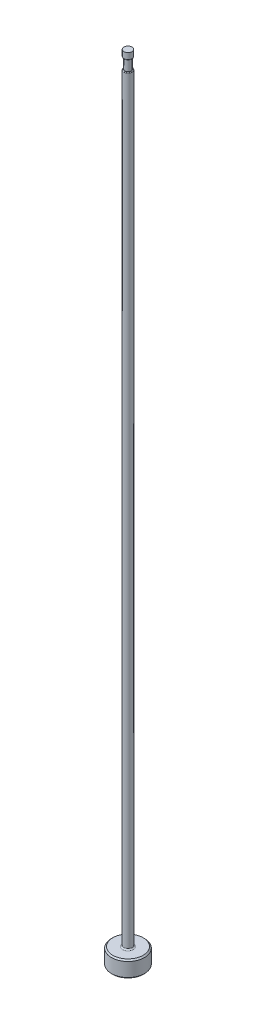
ISO-10303-21;
HEADER;
FILE_DESCRIPTION(('STEP AP214'),'2;1');
FILE_NAME('part.step','',(''),(''),'','','');
FILE_SCHEMA(('AUTOMOTIVE_DESIGN { 1 0 10303 214 1 1 1 1 }'));
ENDSEC;
DATA;
#1=APPLICATION_CONTEXT('core data for automotive mechanical design processes');
#2=APPLICATION_PROTOCOL_DEFINITION('international standard','automotive_design',2000,#1);
#3=PRODUCT_CONTEXT('',#1,'mechanical');
#4=PRODUCT('Part','Part','',(#3));
#5=PRODUCT_RELATED_PRODUCT_CATEGORY('part','',(#4));
#6=PRODUCT_DEFINITION_FORMATION('','',#4);
#7=PRODUCT_DEFINITION_CONTEXT('part definition',#1,'design');
#8=PRODUCT_DEFINITION('design','',#6,#7);
#9=PRODUCT_DEFINITION_SHAPE('','',#8);
#10=(LENGTH_UNIT() NAMED_UNIT(*) SI_UNIT(.MILLI.,.METRE.));
#11=(NAMED_UNIT(*) PLANE_ANGLE_UNIT() SI_UNIT($,.RADIAN.));
#12=(NAMED_UNIT(*) SI_UNIT($,.STERADIAN.) SOLID_ANGLE_UNIT());
#13=UNCERTAINTY_MEASURE_WITH_UNIT(LENGTH_MEASURE(1.E-05),#10,'distance_accuracy_value','');
#14=(GEOMETRIC_REPRESENTATION_CONTEXT(3) GLOBAL_UNCERTAINTY_ASSIGNED_CONTEXT((#13)) GLOBAL_UNIT_ASSIGNED_CONTEXT((#10,
#11,#12)) REPRESENTATION_CONTEXT('',''));
#15=CARTESIAN_POINT('',(0.,0.,0.));
#16=DIRECTION('',(0.,0.,1.));
#17=DIRECTION('',(1.,0.,0.));
#18=AXIS2_PLACEMENT_3D('',#15,#16,#17);
#19=CARTESIAN_POINT('',(-0.793749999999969,151.13,0.));
#20=DIRECTION('',(0.,1.,0.));
#21=DIRECTION('',(0.,0.,1.));
#22=AXIS2_PLACEMENT_3D('',#19,#20,#21);
#23=PLANE('',#22);
#24=CARTESIAN_POINT('',(0.,151.13,0.));
#25=DIRECTION('',(0.,1.,0.));
#26=DIRECTION('',(0.,0.,1.));
#27=AXIS2_PLACEMENT_3D('',#24,#25,#26);
#28=CIRCLE('',#27,0.654049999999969);
#29=CARTESIAN_POINT('',(0.,151.13,0.654049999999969));
#30=VERTEX_POINT('',#29);
#31=EDGE_CURVE('E11',#30,#30,#28,.F.);
#32=ORIENTED_EDGE('',*,*,#31,.T.);
#33=EDGE_LOOP('',(#32));
#34=FACE_BOUND('',#33,.T.);
#35=CARTESIAN_POINT('',(0.,151.13,0.));
#36=DIRECTION('',(0.,1.,0.));
#37=DIRECTION('',(0.,0.,1.));
#38=AXIS2_PLACEMENT_3D('',#35,#36,#37);
#39=CIRCLE('',#38,0.590549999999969);
#40=CARTESIAN_POINT('',(0.,151.13,0.590549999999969));
#41=VERTEX_POINT('',#40);
#42=EDGE_CURVE('E78',#41,#41,#39,.T.);
#43=ORIENTED_EDGE('',*,*,#42,.T.);
#44=EDGE_LOOP('',(#43));
#45=FACE_BOUND('',#44,.T.);
#46=ADVANCED_FACE('F36',(#34,#45),#23,.F.);
#47=CARTESIAN_POINT('',(0.,259.958771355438,0.));
#48=DIRECTION('',(0.,1.,0.));
#49=DIRECTION('',(0.,0.,1.));
#50=AXIS2_PLACEMENT_3D('',#47,#48,#49);
#51=CYLINDRICAL_SURFACE('',#50,0.793749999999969);
#52=DIRECTION('',(0.,1.,0.));
#53=VECTOR('',#52,1.);
#54=CARTESIAN_POINT('',(-0.590549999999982,259.958771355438,-0.530367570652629));
#55=LINE('',#54,#53);
#56=CARTESIAN_POINT('',(-0.590549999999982,148.971,-0.530367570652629));
#57=VERTEX_POINT('',#56);
#58=CARTESIAN_POINT('',(-0.590549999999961,86.614,-0.530367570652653));
#59=VERTEX_POINT('',#58);
#60=EDGE_CURVE('E73',#57,#59,#55,.F.);
#61=ORIENTED_EDGE('',*,*,#60,.F.);
#62=CARTESIAN_POINT('',(0.,148.971,0.));
#63=DIRECTION('',(0.,-1.,0.));
#64=DIRECTION('',(0.,0.,-1.));
#65=AXIS2_PLACEMENT_3D('',#62,#63,#64);
#66=CIRCLE('',#65,0.793749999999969);
#67=CARTESIAN_POINT('',(-0.590549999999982,148.971,0.530367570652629));
#68=VERTEX_POINT('',#67);
#69=EDGE_CURVE('E51',#57,#68,#66,.T.);
#70=ORIENTED_EDGE('',*,*,#69,.T.);
#71=DIRECTION('',(0.,1.,0.));
#72=VECTOR('',#71,1.);
#73=CARTESIAN_POINT('',(-0.590549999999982,259.958771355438,0.530367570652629));
#74=LINE('',#73,#72);
#75=CARTESIAN_POINT('',(-0.590549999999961,86.614,0.530367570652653));
#76=VERTEX_POINT('',#75);
#77=EDGE_CURVE('E84',#76,#68,#74,.T.);
#78=ORIENTED_EDGE('',*,*,#77,.F.);
#79=CARTESIAN_POINT('',(-0.590549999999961,86.614,-0.530367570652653));
#80=CARTESIAN_POINT('',(-0.59053917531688,86.5581966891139,-0.530314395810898));
#81=CARTESIAN_POINT('',(-0.592020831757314,86.5023728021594,-0.528725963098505));
#82=CARTESIAN_POINT('',(-0.597911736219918,86.3908205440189,-0.522091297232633));
#83=CARTESIAN_POINT('',(-0.602334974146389,86.3350939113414,-0.517028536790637));
#84=CARTESIAN_POINT('',(-0.614284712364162,86.2222022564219,-0.502771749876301));
#85=CARTESIAN_POINT('',(-0.621928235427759,86.1650688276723,-0.493420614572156));
#86=CARTESIAN_POINT('',(-0.640090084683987,86.0524288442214,-0.469629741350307));
#87=CARTESIAN_POINT('',(-0.650601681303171,85.9969188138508,-0.455201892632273));
#88=CARTESIAN_POINT('',(-0.672694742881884,85.8947751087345,-0.421752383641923));
#89=CARTESIAN_POINT('',(-0.684015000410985,85.8478538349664,-0.403447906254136));
#90=CARTESIAN_POINT('',(-0.707793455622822,85.7579254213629,-0.360113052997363));
#91=CARTESIAN_POINT('',(-0.720238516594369,85.7148824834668,-0.335155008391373));
#92=CARTESIAN_POINT('',(-0.738199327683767,85.6568429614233,-0.292081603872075));
#93=CARTESIAN_POINT('',(-0.743831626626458,85.6392421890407,-0.277537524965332));
#94=CARTESIAN_POINT('',(-0.754779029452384,85.6059385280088,-0.246220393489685));
#95=CARTESIAN_POINT('',(-0.760093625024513,85.5902386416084,-0.229443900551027));
#96=CARTESIAN_POINT('',(-0.770096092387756,85.5613279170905,-0.193256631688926));
#97=CARTESIAN_POINT('',(-0.774774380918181,85.5481541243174,-0.173812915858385));
#98=CARTESIAN_POINT('',(-0.782879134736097,85.525678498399,-0.132572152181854));
#99=CARTESIAN_POINT('',(-0.786309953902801,85.5163631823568,-0.110783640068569));
#100=CARTESIAN_POINT('',(-0.790553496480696,85.5049260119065,-0.0728220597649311));
#101=CARTESIAN_POINT('',(-0.791853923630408,85.5014525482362,-0.0571082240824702));
#102=CARTESIAN_POINT('',(-0.793506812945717,85.4970442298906,-0.02527858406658));
#103=CARTESIAN_POINT('',(-0.79385989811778,85.4961077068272,-0.00916305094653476));
#104=CARTESIAN_POINT('',(-0.79357975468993,85.4968527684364,0.0230049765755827));
#105=CARTESIAN_POINT('',(-0.792946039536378,85.4985356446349,0.0390574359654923));
#106=CARTESIAN_POINT('',(-0.790759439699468,85.5043804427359,0.0706385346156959));
#107=CARTESIAN_POINT('',(-0.789205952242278,85.5085439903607,0.086166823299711));
#108=CARTESIAN_POINT('',(-0.78484716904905,85.5203438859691,0.120053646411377));
#109=CARTESIAN_POINT('',(-0.781828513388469,85.5285809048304,0.138174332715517));
#110=CARTESIAN_POINT('',(-0.774926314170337,85.5477453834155,0.172744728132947));
#111=CARTESIAN_POINT('',(-0.77104126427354,85.5586775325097,0.189191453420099));
#112=CARTESIAN_POINT('',(-0.760742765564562,85.5882791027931,0.227766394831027));
#113=CARTESIAN_POINT('',(-0.754005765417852,85.6081551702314,0.248875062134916));
#114=CARTESIAN_POINT('',(-0.740079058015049,85.6508481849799,0.287657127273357));
#115=CARTESIAN_POINT('',(-0.732888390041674,85.6736714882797,0.305322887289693));
#116=CARTESIAN_POINT('',(-0.713188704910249,85.7390259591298,0.349810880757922));
#117=CARTESIAN_POINT('',(-0.700707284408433,85.7835752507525,0.373653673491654));
#118=CARTESIAN_POINT('',(-0.677153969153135,85.8759372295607,0.414797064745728));
#119=CARTESIAN_POINT('',(-0.666086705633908,85.9237598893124,0.432076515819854));
#120=CARTESIAN_POINT('',(-0.646811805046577,86.0171939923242,0.460367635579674));
#121=CARTESIAN_POINT('',(-0.638441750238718,86.0626519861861,0.4717848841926));
#122=CARTESIAN_POINT('',(-0.623612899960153,86.1546203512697,0.491217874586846));
#123=CARTESIAN_POINT('',(-0.617155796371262,86.2011316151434,0.499230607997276));
#124=CARTESIAN_POINT('',(-0.606291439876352,86.2947368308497,0.512368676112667));
#125=CARTESIAN_POINT('',(-0.601882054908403,86.3418301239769,0.517497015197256));
#126=CARTESIAN_POINT('',(-0.59516857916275,86.4363714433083,0.525204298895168));
#127=CARTESIAN_POINT('',(-0.592864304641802,86.4838194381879,0.527783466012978));
#128=CARTESIAN_POINT('',(-0.591267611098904,86.5451029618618,0.529567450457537));
#129=CARTESIAN_POINT('',(-0.590998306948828,86.5588916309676,0.52986795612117));
#130=CARTESIAN_POINT('',(-0.590639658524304,86.586453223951,0.530267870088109));
#131=CARTESIAN_POINT('',(-0.59055004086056,86.6002261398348,0.530367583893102));
#132=CARTESIAN_POINT('',(-0.59054999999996,86.6139999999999,0.530367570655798));
#133=B_SPLINE_CURVE_WITH_KNOTS('',3,(#79,#80,#81,#82,#83,#84,#85,#86,#87,#88,#89,#90,#91,#92,
#93,#94,#95,#96,#97,#98,#99,#100,#101,#102,#103,#104,#105,#106,#107,#108,#109,#110,#111,#112,
#113,#114,#115,#116,#117,#118,#119,#120,#121,#122,#123,#124,#125,#126,#127,#128,#129,#130,#131,
#132),.UNSPECIFIED.,.F.,.F.,(4,2,2,2,2,2,2,2,2,2,2,2,2,2,2,2,2,2,2,2,2,2,2,2,2,2,4),(0.,
0.167401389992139,0.335604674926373,0.510534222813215,0.68505679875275,0.839551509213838,
0.992430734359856,1.0628421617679,1.13336338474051,1.20485071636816,1.27608609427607,
1.32431373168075,1.3725096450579,1.42072932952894,1.46898064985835,1.52904518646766,
1.5892149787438,1.67801053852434,1.76700089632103,1.92226871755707,2.0780326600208,
2.22066560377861,2.3634243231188,2.50603406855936,2.6486313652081,2.69001340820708,
2.73133244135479),.UNSPECIFIED.);
#134=EDGE_CURVE('E81',#59,#76,#133,.T.);
#135=ORIENTED_EDGE('',*,*,#134,.F.);
#136=EDGE_LOOP('',(#61,#70,#78,#135));
#137=FACE_BOUND('',#136,.T.);
#138=CARTESIAN_POINT('',(0.,3.42900000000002,0.));
#139=DIRECTION('',(0.,1.,0.));
#140=DIRECTION('',(0.,0.,1.));
#141=AXIS2_PLACEMENT_3D('',#138,#139,#140);
#142=CIRCLE('',#141,0.793749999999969);
#143=CARTESIAN_POINT('',(0.,3.42900000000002,0.793749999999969));
#144=VERTEX_POINT('',#143);
#145=EDGE_CURVE('E116',#144,#144,#142,.T.);
#146=ORIENTED_EDGE('',*,*,#145,.T.);
#147=EDGE_LOOP('',(#146));
#148=FACE_BOUND('',#147,.T.);
#149=ADVANCED_FACE('F82',(#137,#148),#51,.T.);
#150=CARTESIAN_POINT('',(0.,0.,0.));
#151=DIRECTION('',(0.,-1.,0.));
#152=DIRECTION('',(0.,0.,-1.));
#153=AXIS2_PLACEMENT_3D('',#150,#151,#152);
#154=PLANE('',#153);
#155=CARTESIAN_POINT('',(0.,0.,0.));
#156=DIRECTION('',(0.,-1.,0.));
#157=DIRECTION('',(0.,0.,-1.));
#158=AXIS2_PLACEMENT_3D('',#155,#156,#157);
#159=CIRCLE('',#158,2.92099999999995);
#160=CARTESIAN_POINT('',(0.,0.,-2.92099999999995));
#161=VERTEX_POINT('',#160);
#162=EDGE_CURVE('E113',#161,#161,#159,.T.);
#163=ORIENTED_EDGE('',*,*,#162,.T.);
#164=EDGE_LOOP('',(#163));
#165=FACE_BOUND('',#164,.T.);
#166=ADVANCED_FACE('F192',(#165),#154,.T.);
#167=CARTESIAN_POINT('',(0.,259.958771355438,0.));
#168=DIRECTION('',(0.,1.,0.));
#169=DIRECTION('',(0.,0.,1.));
#170=AXIS2_PLACEMENT_3D('',#167,#168,#169);
#171=CYLINDRICAL_SURFACE('',#170,3.17499999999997);
#172=CARTESIAN_POINT('',(0.,2.92100000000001,0.));
#173=DIRECTION('',(0.,1.,0.));
#174=DIRECTION('',(0.,0.,1.));
#175=AXIS2_PLACEMENT_3D('',#172,#173,#174);
#176=CIRCLE('',#175,3.17499999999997);
#177=CARTESIAN_POINT('',(0.,2.92100000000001,3.17499999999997));
#178=VERTEX_POINT('',#177);
#179=EDGE_CURVE('E110',#178,#178,#176,.F.);
#180=ORIENTED_EDGE('',*,*,#179,.T.);
#181=EDGE_LOOP('',(#180));
#182=FACE_BOUND('',#181,.T.);
#183=CARTESIAN_POINT('',(0.,0.254000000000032,0.));
#184=DIRECTION('',(0.,-1.,0.));
#185=DIRECTION('',(0.,0.,-1.));
#186=AXIS2_PLACEMENT_3D('',#183,#184,#185);
#187=CIRCLE('',#186,3.17499999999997);
#188=CARTESIAN_POINT('',(0.,0.254000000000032,-3.17499999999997));
#189=VERTEX_POINT('',#188);
#190=EDGE_CURVE('E107',#189,#189,#187,.F.);
#191=ORIENTED_EDGE('',*,*,#190,.T.);
#192=EDGE_LOOP('',(#191));
#193=FACE_BOUND('',#192,.T.);
#194=ADVANCED_FACE('F195',(#182,#193),#171,.T.);
#195=CARTESIAN_POINT('',(-3.17499999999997,3.175,0.));
#196=DIRECTION('',(0.,1.,0.));
#197=DIRECTION('',(0.,0.,1.));
#198=AXIS2_PLACEMENT_3D('',#195,#196,#197);
#199=PLANE('',#198);
#200=CARTESIAN_POINT('',(0.,3.175,0.));
#201=DIRECTION('',(0.,1.,0.));
#202=DIRECTION('',(0.,0.,1.));
#203=AXIS2_PLACEMENT_3D('',#200,#201,#202);
#204=CIRCLE('',#203,1.04774999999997);
#205=CARTESIAN_POINT('',(0.,3.175,1.04774999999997));
#206=VERTEX_POINT('',#205);
#207=EDGE_CURVE('E87',#206,#206,#204,.F.);
#208=ORIENTED_EDGE('',*,*,#207,.T.);
#209=EDGE_LOOP('',(#208));
#210=FACE_BOUND('',#209,.T.);
#211=CARTESIAN_POINT('',(0.,3.175,0.));
#212=DIRECTION('',(0.,1.,0.));
#213=DIRECTION('',(0.,0.,1.));
#214=AXIS2_PLACEMENT_3D('',#211,#212,#213);
#215=CIRCLE('',#214,2.92099999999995);
#216=CARTESIAN_POINT('',(0.,3.175,2.92099999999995));
#217=VERTEX_POINT('',#216);
#218=EDGE_CURVE('E104',#217,#217,#215,.T.);
#219=ORIENTED_EDGE('',*,*,#218,.T.);
#220=EDGE_LOOP('',(#219));
#221=FACE_BOUND('',#220,.T.);
#222=ADVANCED_FACE('F190',(#210,#221),#199,.T.);
#223=CARTESIAN_POINT('',(0.,3.17499999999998,0.));
#224=DIRECTION('',(0.,-1.,0.));
#225=DIRECTION('',(0.,0.,-1.));
#226=AXIS2_PLACEMENT_3D('',#223,#224,#225);
#227=CONICAL_SURFACE('',#226,2.92099999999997,0.7853981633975);
#228=ORIENTED_EDGE('',*,*,#179,.F.);
#229=EDGE_LOOP('',(#228));
#230=FACE_BOUND('',#229,.T.);
#231=ORIENTED_EDGE('',*,*,#218,.F.);
#232=EDGE_LOOP('',(#231));
#233=FACE_BOUND('',#232,.T.);
#234=ADVANCED_FACE('F186',(#230,#233),#227,.T.);
#235=CARTESIAN_POINT('',(0.,0.254000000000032,0.));
#236=DIRECTION('',(0.,1.,0.));
#237=DIRECTION('',(0.,0.,1.));
#238=AXIS2_PLACEMENT_3D('',#235,#236,#237);
#239=CONICAL_SURFACE('',#238,3.17499999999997,0.785398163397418);
#240=ORIENTED_EDGE('',*,*,#162,.F.);
#241=EDGE_LOOP('',(#240));
#242=FACE_BOUND('',#241,.T.);
#243=ORIENTED_EDGE('',*,*,#190,.F.);
#244=EDGE_LOOP('',(#243));
#245=FACE_BOUND('',#244,.T.);
#246=ADVANCED_FACE('F182',(#242,#245),#239,.T.);
#247=CARTESIAN_POINT('',(0.,3.42900000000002,0.));
#248=DIRECTION('',(0.,1.,0.));
#249=DIRECTION('',(0.,0.,1.));
#250=AXIS2_PLACEMENT_3D('',#247,#248,#249);
#251=TOROIDAL_SURFACE('',#250,1.04774999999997,0.254);
#252=ORIENTED_EDGE('',*,*,#207,.F.);
#253=EDGE_LOOP('',(#252));
#254=FACE_BOUND('',#253,.T.);
#255=ORIENTED_EDGE('',*,*,#145,.F.);
#256=EDGE_LOOP('',(#255));
#257=FACE_BOUND('',#256,.T.);
#258=ADVANCED_FACE('F147',(#254,#257),#251,.F.);
#259=CARTESIAN_POINT('',(-0.793749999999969,149.098,0.));
#260=DIRECTION('',(0.,-1.,0.));
#261=DIRECTION('',(0.,0.,-1.));
#262=AXIS2_PLACEMENT_3D('',#259,#260,#261);
#263=PLANE('',#262);
#264=DIRECTION('',(0.,0.,1.));
#265=VECTOR('',#264,1.);
#266=CARTESIAN_POINT('',(-0.590549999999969,149.098,0.));
#267=LINE('',#266,#265);
#268=CARTESIAN_POINT('',(-0.590549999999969,149.098,0.));
#269=VERTEX_POINT('',#268);
#270=CARTESIAN_POINT('',(-0.590549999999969,149.098,0.309525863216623));
#271=VERTEX_POINT('',#270);
#272=EDGE_CURVE('E90',#269,#271,#267,.T.);
#273=ORIENTED_EDGE('',*,*,#272,.T.);
#274=CARTESIAN_POINT('',(0.,149.098,0.));
#275=DIRECTION('',(0.,-1.,0.));
#276=DIRECTION('',(0.,0.,-1.));
#277=AXIS2_PLACEMENT_3D('',#274,#275,#276);
#278=CIRCLE('',#277,0.666749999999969);
#279=CARTESIAN_POINT('',(-0.590549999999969,149.098,-0.309525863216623));
#280=VERTEX_POINT('',#279);
#281=EDGE_CURVE('E86',#271,#280,#278,.F.);
#282=ORIENTED_EDGE('',*,*,#281,.T.);
#283=EDGE_CURVE('E79',#280,#269,#267,.T.);
#284=ORIENTED_EDGE('',*,*,#283,.T.);
#285=CARTESIAN_POINT('',(0.,149.098,0.));
#286=DIRECTION('',(0.,1.,0.));
#287=DIRECTION('',(0.,0.,1.));
#288=AXIS2_PLACEMENT_3D('',#285,#286,#287);
#289=CIRCLE('',#288,0.590549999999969);
#290=EDGE_CURVE('E101',#269,#269,#289,.T.);
#291=ORIENTED_EDGE('',*,*,#290,.F.);
#292=EDGE_LOOP('',(#273,#282,#284,#291));
#293=FACE_BOUND('',#292,.T.);
#294=ADVANCED_FACE('F144',(#293),#263,.F.);
#295=CARTESIAN_POINT('',(0.,153.448281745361,0.));
#296=DIRECTION('',(0.,1.,0.));
#297=DIRECTION('',(0.,0.,1.));
#298=AXIS2_PLACEMENT_3D('',#295,#296,#297);
#299=CYLINDRICAL_SURFACE('',#298,0.590549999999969);
#300=ORIENTED_EDGE('',*,*,#42,.F.);
#301=EDGE_LOOP('',(#300));
#302=FACE_BOUND('',#301,.T.);
#303=ORIENTED_EDGE('',*,*,#290,.T.);
#304=EDGE_LOOP('',(#303));
#305=FACE_BOUND('',#304,.T.);
#306=ADVANCED_FACE('F141',(#302,#305),#299,.T.);
#307=CARTESIAN_POINT('',(-0.590549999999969,150.114,-3.17499999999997));
#308=DIRECTION('',(1.,0.,0.));
#309=DIRECTION('',(0.,1.,0.));
#310=AXIS2_PLACEMENT_3D('',#307,#308,#309);
#311=PLANE('',#310);
#312=ORIENTED_EDGE('',*,*,#283,.F.);
#313=CARTESIAN_POINT('',(-0.590549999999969,149.098,-0.309525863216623));
#314=CARTESIAN_POINT('',(-0.590549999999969,149.097996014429,-0.320154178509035));
#315=CARTESIAN_POINT('',(-0.590549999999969,149.097711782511,-0.330794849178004));
#316=CARTESIAN_POINT('',(-0.590549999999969,149.096412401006,-0.352104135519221));
#317=CARTESIAN_POINT('',(-0.590549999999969,149.095392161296,-0.362772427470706));
#318=CARTESIAN_POINT('',(-0.590549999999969,149.092423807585,-0.384147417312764));
#319=CARTESIAN_POINT('',(-0.590549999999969,149.090462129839,-0.394852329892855));
#320=CARTESIAN_POINT('',(-0.590549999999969,149.085396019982,-0.415965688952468));
#321=CARTESIAN_POINT('',(-0.590549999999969,149.08229522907,-0.426374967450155));
#322=CARTESIAN_POINT('',(-0.590549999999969,149.075886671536,-0.443512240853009));
#323=CARTESIAN_POINT('',(-0.590549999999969,149.072944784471,-0.450376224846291));
#324=CARTESIAN_POINT('',(-0.590549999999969,149.066316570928,-0.463725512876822));
#325=CARTESIAN_POINT('',(-0.590549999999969,149.062631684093,-0.470211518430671));
#326=CARTESIAN_POINT('',(-0.590549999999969,149.054387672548,-0.482700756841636));
#327=CARTESIAN_POINT('',(-0.590549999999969,149.049820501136,-0.488698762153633));
#328=CARTESIAN_POINT('',(-0.590549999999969,149.039766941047,-0.499879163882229));
#329=CARTESIAN_POINT('',(-0.590549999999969,149.034281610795,-0.505062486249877));
#330=CARTESIAN_POINT('',(-0.590549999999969,149.024008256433,-0.513019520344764));
#331=CARTESIAN_POINT('',(-0.590549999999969,149.019432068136,-0.5160659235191));
#332=CARTESIAN_POINT('',(-0.590549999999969,149.009852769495,-0.521376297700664));
#333=CARTESIAN_POINT('',(-0.590549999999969,149.004850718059,-0.523642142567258));
#334=CARTESIAN_POINT('',(-0.590549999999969,148.995098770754,-0.527042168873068));
#335=CARTESIAN_POINT('',(-0.590549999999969,148.990383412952,-0.528274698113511));
#336=CARTESIAN_POINT('',(-0.590549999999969,148.98078232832,-0.52994444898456));
#337=CARTESIAN_POINT('',(-0.590549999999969,148.97589566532,-0.530376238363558));
#338=CARTESIAN_POINT('',(-0.590549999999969,148.971,-0.530367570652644));
#339=B_SPLINE_CURVE_WITH_KNOTS('',3,(#313,#314,#315,#316,#317,#318,#319,#320,#321,#322,#323,
#324,#325,#326,#327,#328,#329,#330,#331,#332,#333,#334,#335,#336,#337,#338),.UNSPECIFIED.,.F.,
.F.,(4,2,2,2,2,2,2,2,2,2,2,2,4),(0.,0.0319002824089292,0.0640233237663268,0.0966237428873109,
0.129120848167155,0.151487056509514,0.173810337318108,0.196347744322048,0.218859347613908,
0.235290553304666,0.251682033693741,0.266237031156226,0.280890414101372),.UNSPECIFIED.);
#340=EDGE_CURVE('E59',#280,#57,#339,.T.);
#341=ORIENTED_EDGE('',*,*,#340,.T.);
#342=ORIENTED_EDGE('',*,*,#60,.T.);
#343=DIRECTION('',(0.,0.,1.));
#344=VECTOR('',#343,1.);
#345=CARTESIAN_POINT('',(-0.590549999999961,86.614,-3.17499999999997));
#346=LINE('',#345,#344);
#347=EDGE_CURVE('E77',#59,#76,#346,.T.);
#348=ORIENTED_EDGE('',*,*,#347,.T.);
#349=ORIENTED_EDGE('',*,*,#77,.T.);
#350=CARTESIAN_POINT('',(-0.590549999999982,148.971,0.530367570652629));
#351=CARTESIAN_POINT('',(-0.590549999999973,148.976430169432,0.530380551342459));
#352=CARTESIAN_POINT('',(-0.59054999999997,148.981846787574,0.529847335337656));
#353=CARTESIAN_POINT('',(-0.590549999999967,148.992444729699,0.527800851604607));
#354=CARTESIAN_POINT('',(-0.590549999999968,148.997627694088,0.526296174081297));
#355=CARTESIAN_POINT('',(-0.590549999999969,149.007636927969,0.522420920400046));
#356=CARTESIAN_POINT('',(-0.590549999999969,149.012464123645,0.520052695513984));
#357=CARTESIAN_POINT('',(-0.590549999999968,149.021699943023,0.514595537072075));
#358=CARTESIAN_POINT('',(-0.590549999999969,149.026107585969,0.511504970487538));
#359=CARTESIAN_POINT('',(-0.590549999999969,149.036154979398,0.503374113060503));
#360=CARTESIAN_POINT('',(-0.590549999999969,149.041566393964,0.498052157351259));
#361=CARTESIAN_POINT('',(-0.590549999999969,149.05146695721,0.486619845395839));
#362=CARTESIAN_POINT('',(-0.590549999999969,149.055954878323,0.480508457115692));
#363=CARTESIAN_POINT('',(-0.590549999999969,149.066155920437,0.464496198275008));
#364=CARTESIAN_POINT('',(-0.590549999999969,149.071326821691,0.454252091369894));
#365=CARTESIAN_POINT('',(-0.590549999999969,149.08006747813,0.433065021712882));
#366=CARTESIAN_POINT('',(-0.590549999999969,149.083627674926,0.422118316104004));
#367=CARTESIAN_POINT('',(-0.590549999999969,149.090882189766,0.3943269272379));
#368=CARTESIAN_POINT('',(-0.590549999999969,149.093749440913,0.377275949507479));
#369=CARTESIAN_POINT('',(-0.590549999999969,149.097271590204,0.343282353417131));
#370=CARTESIAN_POINT('',(-0.590549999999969,149.097970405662,0.326344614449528));
#371=CARTESIAN_POINT('',(-0.590549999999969,149.098,0.309525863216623));
#372=B_SPLINE_CURVE_WITH_KNOTS('',3,(#350,#351,#352,#353,#354,#355,#356,#357,#358,#359,#360,
#361,#362,#363,#364,#365,#366,#367,#368,#369,#370,#371),.UNSPECIFIED.,.F.,.F.,(4,2,2,2,2,2,2,2,
2,2,4),(0.,0.0162429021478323,0.0323441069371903,0.0484017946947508,0.0644961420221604,
0.0871387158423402,0.109811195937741,0.144045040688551,0.178479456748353,0.230172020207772,
0.280810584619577),.UNSPECIFIED.);
#373=EDGE_CURVE('E172',#68,#271,#372,.T.);
#374=ORIENTED_EDGE('',*,*,#373,.T.);
#375=ORIENTED_EDGE('',*,*,#272,.F.);
#376=EDGE_LOOP('',(#312,#341,#342,#348,#349,#374,#375));
#377=FACE_BOUND('',#376,.T.);
#378=ADVANCED_FACE('F75',(#377),#311,.F.);
#379=CARTESIAN_POINT('',(-3.76554999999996,86.614,-3.17499999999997));
#380=DIRECTION('',(0.,0.,1.));
#381=DIRECTION('',(1.,0.,0.));
#382=AXIS2_PLACEMENT_3D('',#379,#380,#381);
#383=CYLINDRICAL_SURFACE('',#382,3.175);
#384=ORIENTED_EDGE('',*,*,#347,.F.);
#385=ORIENTED_EDGE('',*,*,#134,.T.);
#386=EDGE_LOOP('',(#384,#385));
#387=FACE_BOUND('',#386,.T.);
#388=ADVANCED_FACE('F89',(#387),#383,.F.);
#389=CARTESIAN_POINT('',(0.,152.687735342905,0.));
#390=DIRECTION('',(0.,1.,0.));
#391=DIRECTION('',(0.,0.,1.));
#392=AXIS2_PLACEMENT_3D('',#389,#390,#391);
#393=CYLINDRICAL_SURFACE('',#392,0.781049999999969);
#394=CARTESIAN_POINT('',(0.,151.257,0.));
#395=DIRECTION('',(0.,1.,0.));
#396=DIRECTION('',(0.,0.,1.));
#397=AXIS2_PLACEMENT_3D('',#394,#395,#396);
#398=CIRCLE('',#397,0.781049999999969);
#399=CARTESIAN_POINT('',(0.,151.257,0.781049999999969));
#400=VERTEX_POINT('',#399);
#401=EDGE_CURVE('E44',#400,#400,#398,.T.);
#402=ORIENTED_EDGE('',*,*,#401,.T.);
#403=EDGE_LOOP('',(#402));
#404=FACE_BOUND('',#403,.T.);
#405=CARTESIAN_POINT('',(0.,152.4,0.));
#406=DIRECTION('',(0.,1.,0.));
#407=DIRECTION('',(0.,0.,1.));
#408=AXIS2_PLACEMENT_3D('',#405,#406,#407);
#409=CIRCLE('',#408,0.781049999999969);
#410=CARTESIAN_POINT('',(0.,152.4,0.781049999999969));
#411=VERTEX_POINT('',#410);
#412=EDGE_CURVE('E91',#411,#411,#409,.T.);
#413=ORIENTED_EDGE('',*,*,#412,.F.);
#414=EDGE_LOOP('',(#413));
#415=FACE_BOUND('',#414,.T.);
#416=ADVANCED_FACE('F135',(#404,#415),#393,.T.);
#417=CARTESIAN_POINT('',(-0.793749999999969,152.4,0.));
#418=DIRECTION('',(0.,1.,0.));
#419=DIRECTION('',(0.,0.,1.));
#420=AXIS2_PLACEMENT_3D('',#417,#418,#419);
#421=PLANE('',#420);
#422=ORIENTED_EDGE('',*,*,#412,.T.);
#423=EDGE_LOOP('',(#422));
#424=FACE_BOUND('',#423,.T.);
#425=ADVANCED_FACE('F149',(#424),#421,.T.);
#426=CARTESIAN_POINT('',(0.,148.971,0.));
#427=DIRECTION('',(0.,-1.,0.));
#428=DIRECTION('',(0.,0.,-1.));
#429=AXIS2_PLACEMENT_3D('',#426,#427,#428);
#430=TOROIDAL_SURFACE('',#429,0.666749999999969,0.127);
#431=ORIENTED_EDGE('',*,*,#373,.F.);
#432=ORIENTED_EDGE('',*,*,#69,.F.);
#433=ORIENTED_EDGE('',*,*,#340,.F.);
#434=ORIENTED_EDGE('',*,*,#281,.F.);
#435=EDGE_LOOP('',(#431,#432,#433,#434));
#436=FACE_BOUND('',#435,.T.);
#437=ADVANCED_FACE('F151',(#436),#430,.T.);
#438=CARTESIAN_POINT('',(0.,151.257,0.));
#439=DIRECTION('',(0.,1.,0.));
#440=DIRECTION('',(0.,0.,1.));
#441=AXIS2_PLACEMENT_3D('',#438,#439,#440);
#442=TOROIDAL_SURFACE('',#441,0.654049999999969,0.127);
#443=ORIENTED_EDGE('',*,*,#31,.F.);
#444=EDGE_LOOP('',(#443));
#445=FACE_BOUND('',#444,.T.);
#446=ORIENTED_EDGE('',*,*,#401,.F.);
#447=EDGE_LOOP('',(#446));
#448=FACE_BOUND('',#447,.T.);
#449=ADVANCED_FACE('F38',(#445,#448),#442,.T.);
#450=CLOSED_SHELL('',(#46,#149,#166,#194,#222,#234,#246,#258,#294,#306,#378,#388,#416,#425,#437,#449));
#451=MANIFOLD_SOLID_BREP('B2',#450);
#452=ADVANCED_BREP_SHAPE_REPRESENTATION('',(#18,#451),#14);
#453=SHAPE_DEFINITION_REPRESENTATION(#9,#452);
ENDSEC;
END-ISO-10303-21;
